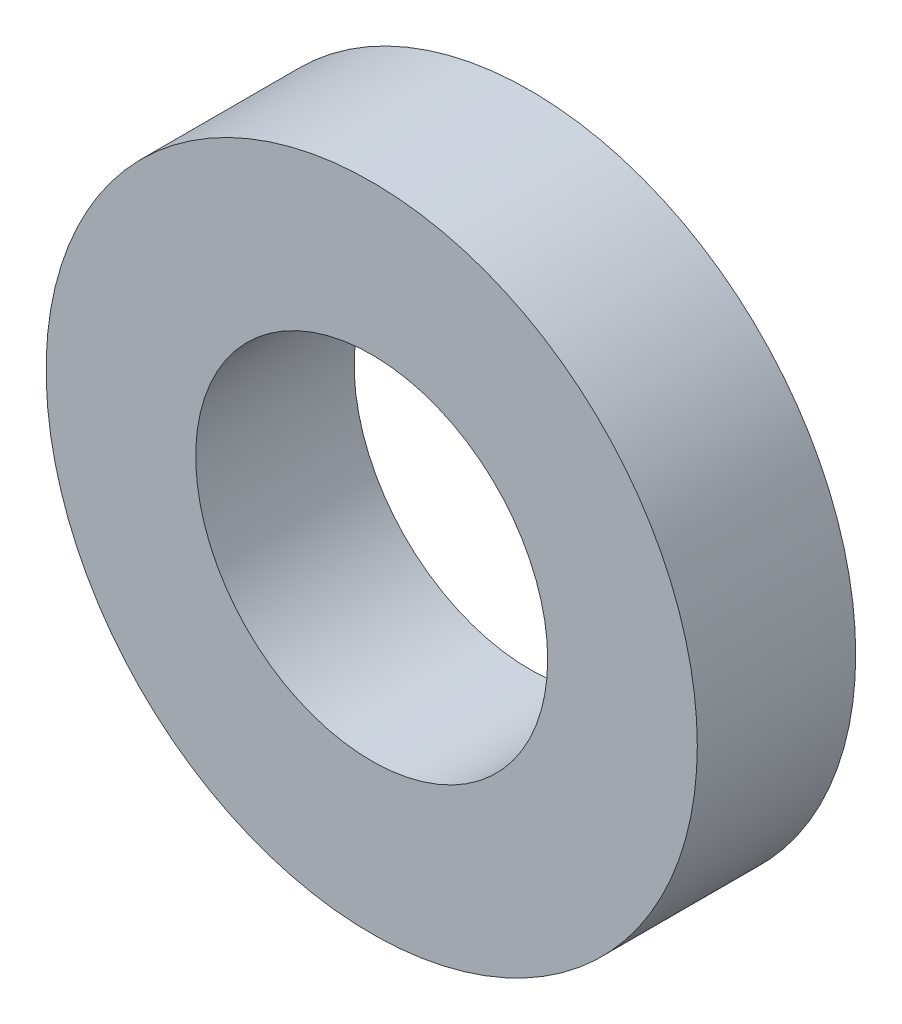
from build123d import *

# Parameters (mm, degrees)
SKETCH1_R           = 18.5
SKETCH1_R_2         = 10
BOSS_EXTRUDE1_DEPTH = 9


with BuildPart() as part:
    # Sketch1 → Boss-Extrude1 (new body)
    with BuildSketch(Plane.XY):
        Circle(SKETCH1_R)
        Circle(SKETCH1_R_2, mode=Mode.SUBTRACT)
    extrude(amount=BOSS_EXTRUDE1_DEPTH)


solid = part.part
